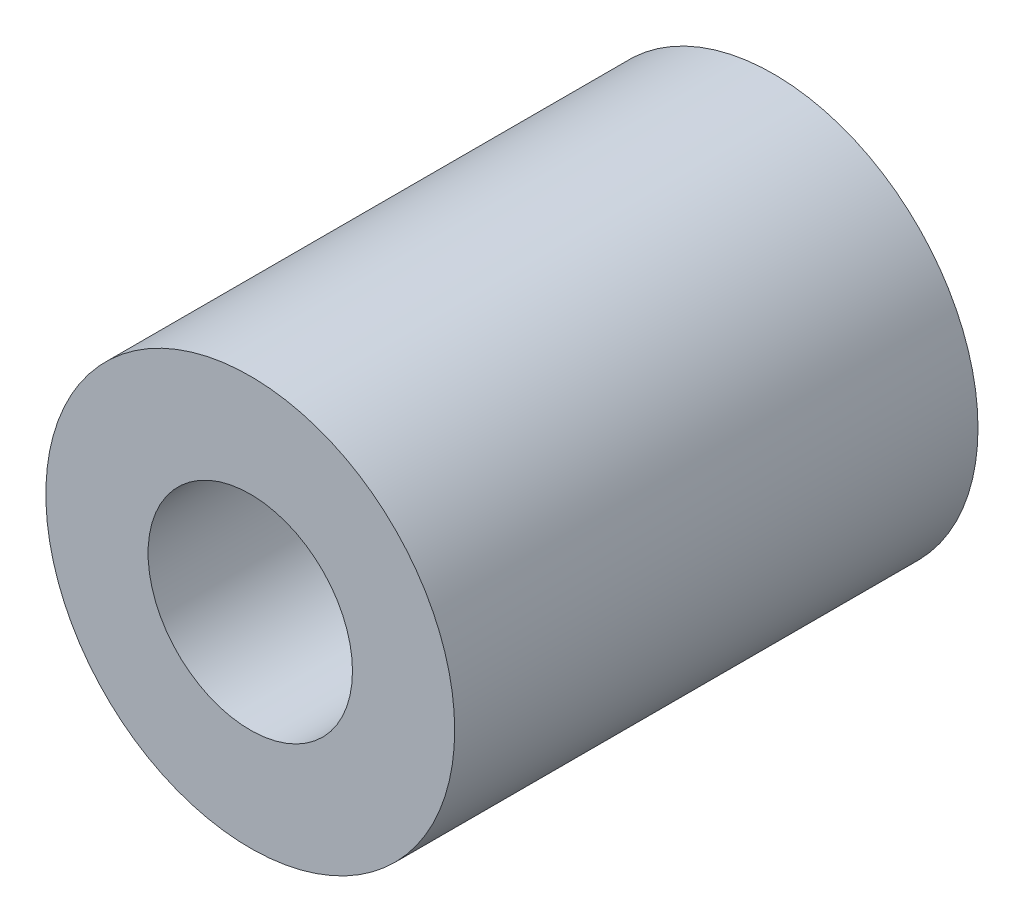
ISO-10303-21;
HEADER;
FILE_DESCRIPTION(('STEP AP214'),'2;1');
FILE_NAME('part.step','',(''),(''),'','','');
FILE_SCHEMA(('AUTOMOTIVE_DESIGN { 1 0 10303 214 1 1 1 1 }'));
ENDSEC;
DATA;
#1=APPLICATION_CONTEXT('core data for automotive mechanical design processes');
#2=APPLICATION_PROTOCOL_DEFINITION('international standard','automotive_design',2000,#1);
#3=PRODUCT_CONTEXT('',#1,'mechanical');
#4=PRODUCT('Part','Part','',(#3));
#5=PRODUCT_RELATED_PRODUCT_CATEGORY('part','',(#4));
#6=PRODUCT_DEFINITION_FORMATION('','',#4);
#7=PRODUCT_DEFINITION_CONTEXT('part definition',#1,'design');
#8=PRODUCT_DEFINITION('design','',#6,#7);
#9=PRODUCT_DEFINITION_SHAPE('','',#8);
#10=(LENGTH_UNIT() NAMED_UNIT(*) SI_UNIT(.MILLI.,.METRE.));
#11=(NAMED_UNIT(*) PLANE_ANGLE_UNIT() SI_UNIT($,.RADIAN.));
#12=(NAMED_UNIT(*) SI_UNIT($,.STERADIAN.) SOLID_ANGLE_UNIT());
#13=UNCERTAINTY_MEASURE_WITH_UNIT(LENGTH_MEASURE(1.E-05),#10,'distance_accuracy_value','');
#14=(GEOMETRIC_REPRESENTATION_CONTEXT(3) GLOBAL_UNCERTAINTY_ASSIGNED_CONTEXT((#13)) GLOBAL_UNIT_ASSIGNED_CONTEXT((#10,
#11,#12)) REPRESENTATION_CONTEXT('',''));
#15=CARTESIAN_POINT('',(0.,0.,0.));
#16=DIRECTION('',(0.,0.,1.));
#17=DIRECTION('',(1.,0.,0.));
#18=AXIS2_PLACEMENT_3D('',#15,#16,#17);
#19=CARTESIAN_POINT('',(0.,0.,64.));
#20=DIRECTION('',(0.,0.,1.));
#21=DIRECTION('',(1.,0.,0.));
#22=AXIS2_PLACEMENT_3D('',#19,#20,#21);
#23=PLANE('',#22);
#24=CARTESIAN_POINT('',(0.,0.,64.));
#25=DIRECTION('',(0.,0.,1.));
#26=DIRECTION('',(1.,0.,0.));
#27=AXIS2_PLACEMENT_3D('',#24,#25,#26);
#28=CIRCLE('',#27,25.);
#29=CARTESIAN_POINT('',(25.,0.,64.));
#30=VERTEX_POINT('',#29);
#31=EDGE_CURVE('E9',#30,#30,#28,.T.);
#32=ORIENTED_EDGE('',*,*,#31,.T.);
#33=EDGE_LOOP('',(#32));
#34=FACE_BOUND('',#33,.T.);
#35=CARTESIAN_POINT('',(0.,0.,64.));
#36=DIRECTION('',(0.,0.,1.));
#37=DIRECTION('',(1.,0.,0.));
#38=AXIS2_PLACEMENT_3D('',#35,#36,#37);
#39=CIRCLE('',#38,12.5);
#40=CARTESIAN_POINT('',(12.5,0.,64.));
#41=VERTEX_POINT('',#40);
#42=EDGE_CURVE('E25',#41,#41,#39,.T.);
#43=ORIENTED_EDGE('',*,*,#42,.F.);
#44=EDGE_LOOP('',(#43));
#45=FACE_BOUND('',#44,.T.);
#46=ADVANCED_FACE('F14',(#34,#45),#23,.T.);
#47=CARTESIAN_POINT('',(0.,0.,0.));
#48=DIRECTION('',(0.,0.,1.));
#49=DIRECTION('',(1.,0.,0.));
#50=AXIS2_PLACEMENT_3D('',#47,#48,#49);
#51=PLANE('',#50);
#52=CARTESIAN_POINT('',(0.,0.,0.));
#53=DIRECTION('',(0.,0.,1.));
#54=DIRECTION('',(1.,0.,0.));
#55=AXIS2_PLACEMENT_3D('',#52,#53,#54);
#56=CIRCLE('',#55,25.);
#57=CARTESIAN_POINT('',(25.,0.,0.));
#58=VERTEX_POINT('',#57);
#59=EDGE_CURVE('E18',#58,#58,#56,.T.);
#60=ORIENTED_EDGE('',*,*,#59,.F.);
#61=EDGE_LOOP('',(#60));
#62=FACE_BOUND('',#61,.T.);
#63=CARTESIAN_POINT('',(0.,0.,0.));
#64=DIRECTION('',(0.,0.,1.));
#65=DIRECTION('',(1.,0.,0.));
#66=AXIS2_PLACEMENT_3D('',#63,#64,#65);
#67=CIRCLE('',#66,12.5);
#68=CARTESIAN_POINT('',(12.5,0.,0.));
#69=VERTEX_POINT('',#68);
#70=EDGE_CURVE('E27',#69,#69,#67,.T.);
#71=ORIENTED_EDGE('',*,*,#70,.T.);
#72=EDGE_LOOP('',(#71));
#73=FACE_BOUND('',#72,.T.);
#74=ADVANCED_FACE('F37',(#62,#73),#51,.F.);
#75=CARTESIAN_POINT('',(0.,0.,64.));
#76=DIRECTION('',(0.,0.,-1.));
#77=DIRECTION('',(-1.,0.,0.));
#78=AXIS2_PLACEMENT_3D('',#75,#76,#77);
#79=CYLINDRICAL_SURFACE('',#78,25.);
#80=ORIENTED_EDGE('',*,*,#31,.F.);
#81=EDGE_LOOP('',(#80));
#82=FACE_BOUND('',#81,.T.);
#83=ORIENTED_EDGE('',*,*,#59,.T.);
#84=EDGE_LOOP('',(#83));
#85=FACE_BOUND('',#84,.T.);
#86=ADVANCED_FACE('F16',(#82,#85),#79,.T.);
#87=CARTESIAN_POINT('',(0.,0.,64.));
#88=DIRECTION('',(0.,0.,-1.));
#89=DIRECTION('',(-1.,0.,0.));
#90=AXIS2_PLACEMENT_3D('',#87,#88,#89);
#91=CYLINDRICAL_SURFACE('',#90,12.5);
#92=ORIENTED_EDGE('',*,*,#42,.T.);
#93=EDGE_LOOP('',(#92));
#94=FACE_BOUND('',#93,.T.);
#95=ORIENTED_EDGE('',*,*,#70,.F.);
#96=EDGE_LOOP('',(#95));
#97=FACE_BOUND('',#96,.T.);
#98=ADVANCED_FACE('F33',(#94,#97),#91,.F.);
#99=CLOSED_SHELL('',(#46,#74,#86,#98));
#100=MANIFOLD_SOLID_BREP('B1',#99);
#101=ADVANCED_BREP_SHAPE_REPRESENTATION('',(#18,#100),#14);
#102=SHAPE_DEFINITION_REPRESENTATION(#9,#101);
ENDSEC;
END-ISO-10303-21;
